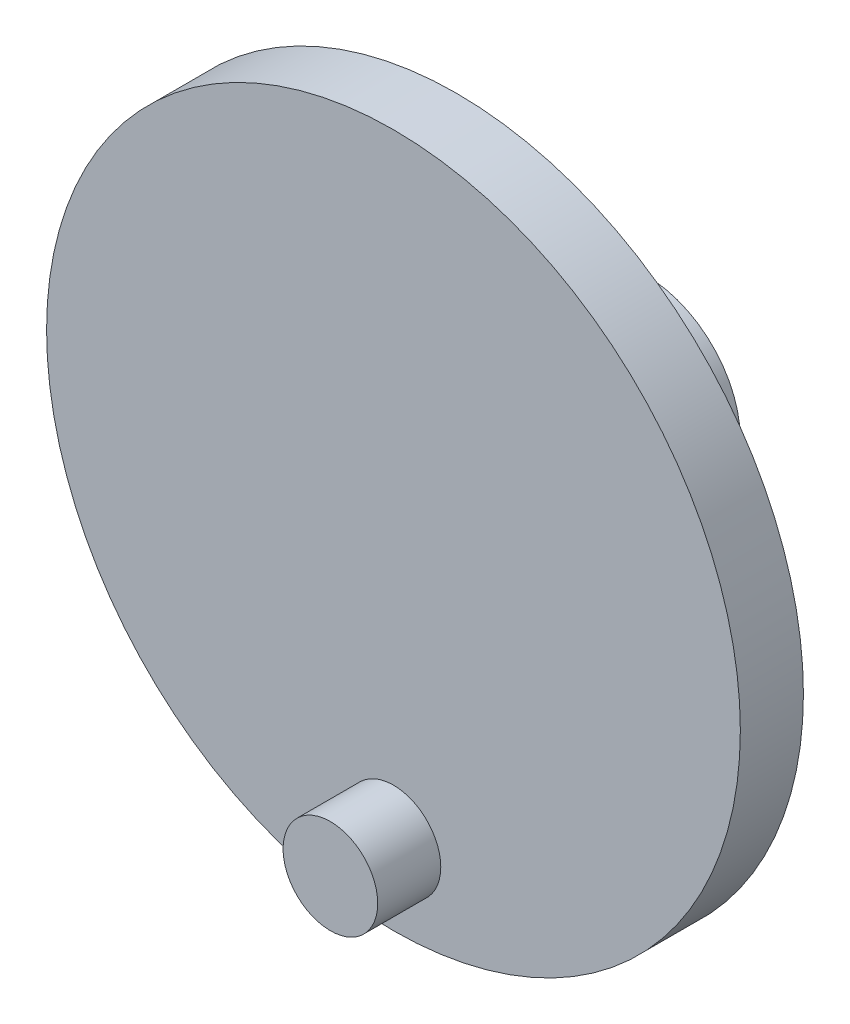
from build123d import *

# Parameters (mm, degrees)
SKETCH_CAM_R        = 55
CAM_DEPTH           = 10
SKETCH_CAM_3_R      = 7.5
CAM_PIVOT_DEPTH     = 10
SKETCH_SPIN_SHAFT_R = 15
SPIN_SHAFT_DEPTH    = 40


with BuildPart() as part:
    # Sketch_Cam → Cam (new body)
    with BuildSketch(Plane.XY):
        Circle(SKETCH_CAM_R)
    extrude(amount=-CAM_DEPTH)

    # Sketch_Cam_3 → Cam Pivot (add)
    with BuildSketch(Plane.XY):
        with Locations((0, -42.5)):
            Circle(SKETCH_CAM_3_R)
    extrude(amount=CAM_PIVOT_DEPTH)

    # Sketch_Spin Shaft → Spin Shaft (add)
    with BuildSketch(Plane.XY):
        Circle(SKETCH_SPIN_SHAFT_R)
    extrude(amount=-SPIN_SHAFT_DEPTH)


solid = part.part
